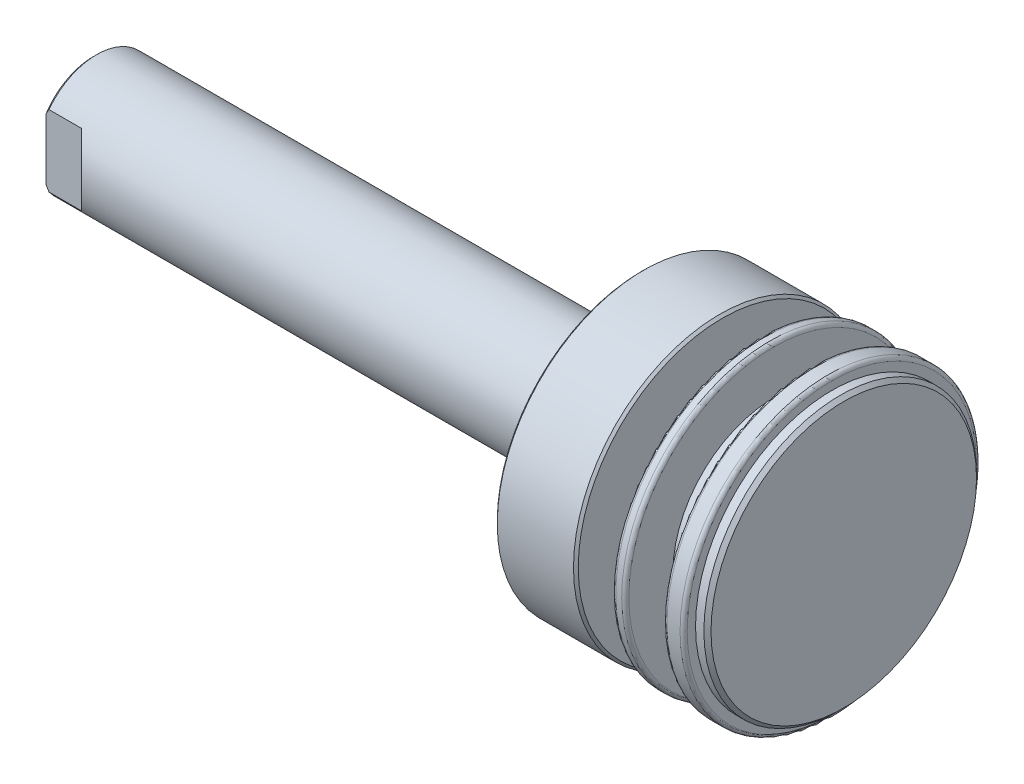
ISO-10303-21;
HEADER;
FILE_DESCRIPTION(('STEP AP214'),'2;1');
FILE_NAME('part.step','',(''),(''),'','','');
FILE_SCHEMA(('AUTOMOTIVE_DESIGN { 1 0 10303 214 1 1 1 1 }'));
ENDSEC;
DATA;
#1=APPLICATION_CONTEXT('core data for automotive mechanical design processes');
#2=APPLICATION_PROTOCOL_DEFINITION('international standard','automotive_design',2000,#1);
#3=PRODUCT_CONTEXT('',#1,'mechanical');
#4=PRODUCT('Part','Part','',(#3));
#5=PRODUCT_RELATED_PRODUCT_CATEGORY('part','',(#4));
#6=PRODUCT_DEFINITION_FORMATION('','',#4);
#7=PRODUCT_DEFINITION_CONTEXT('part definition',#1,'design');
#8=PRODUCT_DEFINITION('design','',#6,#7);
#9=PRODUCT_DEFINITION_SHAPE('','',#8);
#10=(LENGTH_UNIT() NAMED_UNIT(*) SI_UNIT(.MILLI.,.METRE.));
#11=(NAMED_UNIT(*) PLANE_ANGLE_UNIT() SI_UNIT($,.RADIAN.));
#12=(NAMED_UNIT(*) SI_UNIT($,.STERADIAN.) SOLID_ANGLE_UNIT());
#13=UNCERTAINTY_MEASURE_WITH_UNIT(LENGTH_MEASURE(1.E-05),#10,'distance_accuracy_value','');
#14=(GEOMETRIC_REPRESENTATION_CONTEXT(3) GLOBAL_UNCERTAINTY_ASSIGNED_CONTEXT((#13)) GLOBAL_UNIT_ASSIGNED_CONTEXT((#10,
#11,#12)) REPRESENTATION_CONTEXT('',''));
#15=CARTESIAN_POINT('',(0.,0.,0.));
#16=DIRECTION('',(0.,0.,1.));
#17=DIRECTION('',(1.,0.,0.));
#18=AXIS2_PLACEMENT_3D('',#15,#16,#17);
#19=CARTESIAN_POINT('',(57.,11.15,0.));
#20=DIRECTION('',(-1.,0.,0.));
#21=DIRECTION('',(0.,0.,1.));
#22=AXIS2_PLACEMENT_3D('',#19,#20,#21);
#23=PLANE('',#22);
#24=CARTESIAN_POINT('',(57.,0.,0.));
#25=DIRECTION('',(-1.,0.,0.));
#26=DIRECTION('',(0.,0.,1.));
#27=AXIS2_PLACEMENT_3D('',#24,#25,#26);
#28=CIRCLE('',#27,11.15);
#29=CARTESIAN_POINT('',(57.,0.,11.15));
#30=VERTEX_POINT('',#29);
#31=EDGE_CURVE('E356',#30,#30,#28,.T.);
#32=ORIENTED_EDGE('',*,*,#31,.F.);
#33=EDGE_LOOP('',(#32));
#34=FACE_BOUND('',#33,.T.);
#35=ADVANCED_FACE('F17',(#34),#23,.F.);
#36=CARTESIAN_POINT('',(56.7,0.,0.));
#37=DIRECTION('',(-1.,0.,0.));
#38=DIRECTION('',(0.,0.,1.));
#39=AXIS2_PLACEMENT_3D('',#36,#37,#38);
#40=CONICAL_SURFACE('',#39,11.45,0.78539816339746);
#41=CARTESIAN_POINT('',(56.7,0.,0.));
#42=DIRECTION('',(-1.,0.,0.));
#43=DIRECTION('',(0.,0.,1.));
#44=AXIS2_PLACEMENT_3D('',#41,#42,#43);
#45=CIRCLE('',#44,11.45);
#46=CARTESIAN_POINT('',(56.7,0.,11.45));
#47=VERTEX_POINT('',#46);
#48=EDGE_CURVE('E348',#47,#47,#45,.T.);
#49=ORIENTED_EDGE('',*,*,#48,.F.);
#50=EDGE_LOOP('',(#49));
#51=FACE_BOUND('',#50,.T.);
#52=ORIENTED_EDGE('',*,*,#31,.T.);
#53=EDGE_LOOP('',(#52));
#54=FACE_BOUND('',#53,.T.);
#55=ADVANCED_FACE('F395',(#51,#54),#40,.T.);
#56=CARTESIAN_POINT('',(57.,0.,0.));
#57=DIRECTION('',(-1.,0.,0.));
#58=DIRECTION('',(0.,0.,1.));
#59=AXIS2_PLACEMENT_3D('',#56,#57,#58);
#60=CYLINDRICAL_SURFACE('',#59,11.45);
#61=CARTESIAN_POINT('',(56.,0.,0.));
#62=DIRECTION('',(-1.,0.,0.));
#63=DIRECTION('',(0.,0.,1.));
#64=AXIS2_PLACEMENT_3D('',#61,#62,#63);
#65=CIRCLE('',#64,11.45);
#66=CARTESIAN_POINT('',(56.,0.,11.45));
#67=VERTEX_POINT('',#66);
#68=EDGE_CURVE('E355',#67,#67,#65,.F.);
#69=ORIENTED_EDGE('',*,*,#68,.T.);
#70=EDGE_LOOP('',(#69));
#71=FACE_BOUND('',#70,.T.);
#72=ORIENTED_EDGE('',*,*,#48,.T.);
#73=EDGE_LOOP('',(#72));
#74=FACE_BOUND('',#73,.T.);
#75=ADVANCED_FACE('F402',(#71,#74),#60,.T.);
#76=CARTESIAN_POINT('',(56.,12.15,0.));
#77=DIRECTION('',(-1.,0.,0.));
#78=DIRECTION('',(0.,0.,1.));
#79=AXIS2_PLACEMENT_3D('',#76,#77,#78);
#80=PLANE('',#79);
#81=ORIENTED_EDGE('',*,*,#68,.F.);
#82=EDGE_LOOP('',(#81));
#83=FACE_BOUND('',#82,.T.);
#84=CARTESIAN_POINT('',(56.,0.,0.));
#85=DIRECTION('',(-1.,0.,0.));
#86=DIRECTION('',(0.,0.,-1.));
#87=AXIS2_PLACEMENT_3D('',#84,#85,#86);
#88=CIRCLE('',#87,12.15);
#89=CARTESIAN_POINT('',(56.,0.,-12.15));
#90=VERTEX_POINT('',#89);
#91=CARTESIAN_POINT('',(56.,0.,12.15));
#92=VERTEX_POINT('',#91);
#93=EDGE_CURVE('E384',#90,#92,#88,.T.);
#94=ORIENTED_EDGE('',*,*,#93,.F.);
#95=CARTESIAN_POINT('',(56.,0.,0.));
#96=DIRECTION('',(-1.,0.,0.));
#97=DIRECTION('',(0.,0.,1.));
#98=AXIS2_PLACEMENT_3D('',#95,#96,#97);
#99=CIRCLE('',#98,12.15);
#100=EDGE_CURVE('E327',#92,#90,#99,.T.);
#101=ORIENTED_EDGE('',*,*,#100,.F.);
#102=EDGE_LOOP('',(#94,#101));
#103=FACE_BOUND('',#102,.T.);
#104=ADVANCED_FACE('F336',(#83,#103),#80,.F.);
#105=CARTESIAN_POINT('',(55.7,0.,0.));
#106=DIRECTION('',(-1.,0.,0.));
#107=DIRECTION('',(0.,0.,1.));
#108=AXIS2_PLACEMENT_3D('',#105,#106,#107);
#109=TOROIDAL_SURFACE('',#108,12.15,0.299999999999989);
#110=CARTESIAN_POINT('',(55.7,0.,0.));
#111=DIRECTION('',(-1.,0.,0.));
#112=DIRECTION('',(0.,0.,1.));
#113=AXIS2_PLACEMENT_3D('',#110,#111,#112);
#114=CIRCLE('',#113,12.45);
#115=CARTESIAN_POINT('',(55.7,0.,12.45));
#116=VERTEX_POINT('',#115);
#117=EDGE_CURVE('E324',#116,#116,#114,.T.);
#118=ORIENTED_EDGE('',*,*,#117,.F.);
#119=EDGE_LOOP('',(#118));
#120=FACE_BOUND('',#119,.T.);
#121=ORIENTED_EDGE('',*,*,#100,.T.);
#122=ORIENTED_EDGE('',*,*,#93,.T.);
#123=EDGE_LOOP('',(#121,#122));
#124=FACE_BOUND('',#123,.T.);
#125=ADVANCED_FACE('F332',(#120,#124),#109,.T.);
#126=CARTESIAN_POINT('',(57.,0.,0.));
#127=DIRECTION('',(-1.,0.,0.));
#128=DIRECTION('',(0.,0.,1.));
#129=AXIS2_PLACEMENT_3D('',#126,#127,#128);
#130=CYLINDRICAL_SURFACE('',#129,12.45);
#131=CARTESIAN_POINT('',(54.6,0.,0.));
#132=DIRECTION('',(-1.,0.,0.));
#133=DIRECTION('',(0.,0.,1.));
#134=AXIS2_PLACEMENT_3D('',#131,#132,#133);
#135=CIRCLE('',#134,12.45);
#136=CARTESIAN_POINT('',(54.6,0.,12.45));
#137=VERTEX_POINT('',#136);
#138=EDGE_CURVE('E316',#137,#137,#135,.T.);
#139=ORIENTED_EDGE('',*,*,#138,.F.);
#140=EDGE_LOOP('',(#139));
#141=FACE_BOUND('',#140,.T.);
#142=ORIENTED_EDGE('',*,*,#117,.T.);
#143=EDGE_LOOP('',(#142));
#144=FACE_BOUND('',#143,.T.);
#145=ADVANCED_FACE('F301',(#141,#144),#130,.T.);
#146=CARTESIAN_POINT('',(54.6,0.,0.));
#147=DIRECTION('',(-1.,0.,0.));
#148=DIRECTION('',(0.,0.,1.));
#149=AXIS2_PLACEMENT_3D('',#146,#147,#148);
#150=TOROIDAL_SURFACE('',#149,12.15,0.299999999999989);
#151=CARTESIAN_POINT('',(54.3,0.,0.));
#152=DIRECTION('',(1.,0.,0.));
#153=DIRECTION('',(0.,0.,1.));
#154=AXIS2_PLACEMENT_3D('',#151,#152,#153);
#155=CIRCLE('',#154,12.15);
#156=CARTESIAN_POINT('',(54.3,0.,12.15));
#157=VERTEX_POINT('',#156);
#158=CARTESIAN_POINT('',(54.3,0.,-12.15));
#159=VERTEX_POINT('',#158);
#160=EDGE_CURVE('E283',#157,#159,#155,.T.);
#161=ORIENTED_EDGE('',*,*,#160,.T.);
#162=CARTESIAN_POINT('',(54.3,0.,0.));
#163=DIRECTION('',(1.,0.,0.));
#164=DIRECTION('',(0.,0.,-1.));
#165=AXIS2_PLACEMENT_3D('',#162,#163,#164);
#166=CIRCLE('',#165,12.15);
#167=EDGE_CURVE('E312',#159,#157,#166,.T.);
#168=ORIENTED_EDGE('',*,*,#167,.T.);
#169=EDGE_LOOP('',(#161,#168));
#170=FACE_BOUND('',#169,.T.);
#171=ORIENTED_EDGE('',*,*,#138,.T.);
#172=EDGE_LOOP('',(#171));
#173=FACE_BOUND('',#172,.T.);
#174=ADVANCED_FACE('F289',(#170,#173),#150,.T.);
#175=CARTESIAN_POINT('',(54.3,8.45,0.));
#176=DIRECTION('',(1.,0.,0.));
#177=DIRECTION('',(0.,0.,-1.));
#178=AXIS2_PLACEMENT_3D('',#175,#176,#177);
#179=PLANE('',#178);
#180=ORIENTED_EDGE('',*,*,#160,.F.);
#181=ORIENTED_EDGE('',*,*,#167,.F.);
#182=EDGE_LOOP('',(#180,#181));
#183=FACE_BOUND('',#182,.T.);
#184=CARTESIAN_POINT('',(54.3,0.,0.));
#185=DIRECTION('',(-1.,0.,0.));
#186=DIRECTION('',(0.,0.,1.));
#187=AXIS2_PLACEMENT_3D('',#184,#185,#186);
#188=CIRCLE('',#187,8.45);
#189=CARTESIAN_POINT('',(54.3,0.,8.45));
#190=VERTEX_POINT('',#189);
#191=EDGE_CURVE('E379',#190,#190,#188,.T.);
#192=ORIENTED_EDGE('',*,*,#191,.F.);
#193=EDGE_LOOP('',(#192));
#194=FACE_BOUND('',#193,.T.);
#195=ADVANCED_FACE('F300',(#183,#194),#179,.F.);
#196=CARTESIAN_POINT('',(57.,0.,0.));
#197=DIRECTION('',(-1.,0.,0.));
#198=DIRECTION('',(0.,0.,1.));
#199=AXIS2_PLACEMENT_3D('',#196,#197,#198);
#200=CYLINDRICAL_SURFACE('',#199,8.45);
#201=CARTESIAN_POINT('',(51.1,0.,0.));
#202=DIRECTION('',(-1.,0.,0.));
#203=DIRECTION('',(0.,0.,1.));
#204=AXIS2_PLACEMENT_3D('',#201,#202,#203);
#205=CIRCLE('',#204,8.45);
#206=CARTESIAN_POINT('',(51.1,0.,8.45));
#207=VERTEX_POINT('',#206);
#208=EDGE_CURVE('E375',#207,#207,#205,.F.);
#209=ORIENTED_EDGE('',*,*,#208,.T.);
#210=EDGE_LOOP('',(#209));
#211=FACE_BOUND('',#210,.T.);
#212=ORIENTED_EDGE('',*,*,#191,.T.);
#213=EDGE_LOOP('',(#212));
#214=FACE_BOUND('',#213,.T.);
#215=ADVANCED_FACE('F530',(#211,#214),#200,.T.);
#216=CARTESIAN_POINT('',(51.1,12.15,0.));
#217=DIRECTION('',(-1.,0.,0.));
#218=DIRECTION('',(0.,0.,1.));
#219=AXIS2_PLACEMENT_3D('',#216,#217,#218);
#220=PLANE('',#219);
#221=ORIENTED_EDGE('',*,*,#208,.F.);
#222=EDGE_LOOP('',(#221));
#223=FACE_BOUND('',#222,.T.);
#224=CARTESIAN_POINT('',(51.1,0.,0.));
#225=DIRECTION('',(-1.,0.,0.));
#226=DIRECTION('',(0.,0.,-1.));
#227=AXIS2_PLACEMENT_3D('',#224,#225,#226);
#228=CIRCLE('',#227,12.15);
#229=CARTESIAN_POINT('',(51.1,0.,-12.15));
#230=VERTEX_POINT('',#229);
#231=CARTESIAN_POINT('',(51.1,0.,12.15));
#232=VERTEX_POINT('',#231);
#233=EDGE_CURVE('E378',#230,#232,#228,.T.);
#234=ORIENTED_EDGE('',*,*,#233,.F.);
#235=CARTESIAN_POINT('',(51.1,0.,0.));
#236=DIRECTION('',(-1.,0.,0.));
#237=DIRECTION('',(0.,0.,1.));
#238=AXIS2_PLACEMENT_3D('',#235,#236,#237);
#239=CIRCLE('',#238,12.15);
#240=EDGE_CURVE('E239',#232,#230,#239,.T.);
#241=ORIENTED_EDGE('',*,*,#240,.F.);
#242=EDGE_LOOP('',(#234,#241));
#243=FACE_BOUND('',#242,.T.);
#244=ADVANCED_FACE('F255',(#223,#243),#220,.F.);
#245=CARTESIAN_POINT('',(50.8,0.,0.));
#246=DIRECTION('',(-1.,0.,0.));
#247=DIRECTION('',(0.,0.,1.));
#248=AXIS2_PLACEMENT_3D('',#245,#246,#247);
#249=TOROIDAL_SURFACE('',#248,12.15,0.299999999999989);
#250=CARTESIAN_POINT('',(50.8,0.,0.));
#251=DIRECTION('',(-1.,0.,0.));
#252=DIRECTION('',(0.,0.,1.));
#253=AXIS2_PLACEMENT_3D('',#250,#251,#252);
#254=CIRCLE('',#253,12.45);
#255=CARTESIAN_POINT('',(50.8,0.,12.45));
#256=VERTEX_POINT('',#255);
#257=EDGE_CURVE('E234',#256,#256,#254,.T.);
#258=ORIENTED_EDGE('',*,*,#257,.F.);
#259=EDGE_LOOP('',(#258));
#260=FACE_BOUND('',#259,.T.);
#261=ORIENTED_EDGE('',*,*,#240,.T.);
#262=ORIENTED_EDGE('',*,*,#233,.T.);
#263=EDGE_LOOP('',(#261,#262));
#264=FACE_BOUND('',#263,.T.);
#265=ADVANCED_FACE('F250',(#260,#264),#249,.T.);
#266=CARTESIAN_POINT('',(57.,0.,0.));
#267=DIRECTION('',(-1.,0.,0.));
#268=DIRECTION('',(0.,0.,1.));
#269=AXIS2_PLACEMENT_3D('',#266,#267,#268);
#270=CYLINDRICAL_SURFACE('',#269,12.45);
#271=CARTESIAN_POINT('',(50.3,0.,0.));
#272=DIRECTION('',(-1.,0.,0.));
#273=DIRECTION('',(0.,0.,1.));
#274=AXIS2_PLACEMENT_3D('',#271,#272,#273);
#275=CIRCLE('',#274,12.45);
#276=CARTESIAN_POINT('',(50.3,0.,12.45));
#277=VERTEX_POINT('',#276);
#278=EDGE_CURVE('E231',#277,#277,#275,.T.);
#279=ORIENTED_EDGE('',*,*,#278,.F.);
#280=EDGE_LOOP('',(#279));
#281=FACE_BOUND('',#280,.T.);
#282=ORIENTED_EDGE('',*,*,#257,.T.);
#283=EDGE_LOOP('',(#282));
#284=FACE_BOUND('',#283,.T.);
#285=ADVANCED_FACE('F254',(#281,#284),#270,.T.);
#286=CARTESIAN_POINT('',(50.3,0.,0.));
#287=DIRECTION('',(-1.,0.,0.));
#288=DIRECTION('',(0.,0.,1.));
#289=AXIS2_PLACEMENT_3D('',#286,#287,#288);
#290=TOROIDAL_SURFACE('',#289,12.15,0.299999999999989);
#291=CARTESIAN_POINT('',(50.,0.,0.));
#292=DIRECTION('',(1.,0.,0.));
#293=DIRECTION('',(0.,0.,1.));
#294=AXIS2_PLACEMENT_3D('',#291,#292,#293);
#295=CIRCLE('',#294,12.15);
#296=CARTESIAN_POINT('',(50.,0.,12.15));
#297=VERTEX_POINT('',#296);
#298=CARTESIAN_POINT('',(50.,0.,-12.15));
#299=VERTEX_POINT('',#298);
#300=EDGE_CURVE('E222',#297,#299,#295,.T.);
#301=ORIENTED_EDGE('',*,*,#300,.T.);
#302=CARTESIAN_POINT('',(50.,0.,0.));
#303=DIRECTION('',(1.,0.,0.));
#304=DIRECTION('',(0.,0.,-1.));
#305=AXIS2_PLACEMENT_3D('',#302,#303,#304);
#306=CIRCLE('',#305,12.15);
#307=EDGE_CURVE('E218',#299,#297,#306,.T.);
#308=ORIENTED_EDGE('',*,*,#307,.T.);
#309=EDGE_LOOP('',(#301,#308));
#310=FACE_BOUND('',#309,.T.);
#311=ORIENTED_EDGE('',*,*,#278,.T.);
#312=EDGE_LOOP('',(#311));
#313=FACE_BOUND('',#312,.T.);
#314=ADVANCED_FACE('F194',(#310,#313),#290,.T.);
#315=CARTESIAN_POINT('',(50.,6.5,0.));
#316=DIRECTION('',(1.,0.,0.));
#317=DIRECTION('',(0.,0.,-1.));
#318=AXIS2_PLACEMENT_3D('',#315,#316,#317);
#319=PLANE('',#318);
#320=ORIENTED_EDGE('',*,*,#300,.F.);
#321=ORIENTED_EDGE('',*,*,#307,.F.);
#322=EDGE_LOOP('',(#320,#321));
#323=FACE_BOUND('',#322,.T.);
#324=CARTESIAN_POINT('',(50.,0.,0.));
#325=DIRECTION('',(-1.,0.,0.));
#326=DIRECTION('',(0.,0.,1.));
#327=AXIS2_PLACEMENT_3D('',#324,#325,#326);
#328=CIRCLE('',#327,6.5);
#329=CARTESIAN_POINT('',(50.,0.,6.5));
#330=VERTEX_POINT('',#329);
#331=EDGE_CURVE('E227',#330,#330,#328,.T.);
#332=ORIENTED_EDGE('',*,*,#331,.F.);
#333=EDGE_LOOP('',(#332));
#334=FACE_BOUND('',#333,.T.);
#335=ADVANCED_FACE('F189',(#323,#334),#319,.F.);
#336=CARTESIAN_POINT('',(57.,0.,0.));
#337=DIRECTION('',(-1.,0.,0.));
#338=DIRECTION('',(0.,0.,1.));
#339=AXIS2_PLACEMENT_3D('',#336,#337,#338);
#340=CYLINDRICAL_SURFACE('',#339,6.5);
#341=CARTESIAN_POINT('',(46.8,0.,0.));
#342=DIRECTION('',(-1.,0.,0.));
#343=DIRECTION('',(0.,0.,1.));
#344=AXIS2_PLACEMENT_3D('',#341,#342,#343);
#345=CIRCLE('',#344,6.5);
#346=CARTESIAN_POINT('',(46.8,0.,6.5));
#347=VERTEX_POINT('',#346);
#348=EDGE_CURVE('E229',#347,#347,#345,.F.);
#349=ORIENTED_EDGE('',*,*,#348,.T.);
#350=EDGE_LOOP('',(#349));
#351=FACE_BOUND('',#350,.T.);
#352=ORIENTED_EDGE('',*,*,#331,.T.);
#353=EDGE_LOOP('',(#352));
#354=FACE_BOUND('',#353,.T.);
#355=ADVANCED_FACE('F185',(#351,#354),#340,.T.);
#356=CARTESIAN_POINT('',(46.8,12.1,0.));
#357=DIRECTION('',(-1.,0.,0.));
#358=DIRECTION('',(0.,0.,1.));
#359=AXIS2_PLACEMENT_3D('',#356,#357,#358);
#360=PLANE('',#359);
#361=ORIENTED_EDGE('',*,*,#348,.F.);
#362=EDGE_LOOP('',(#361));
#363=FACE_BOUND('',#362,.T.);
#364=CARTESIAN_POINT('',(46.8,0.,0.));
#365=DIRECTION('',(-1.,0.,0.));
#366=DIRECTION('',(0.,0.,1.));
#367=AXIS2_PLACEMENT_3D('',#364,#365,#366);
#368=CIRCLE('',#367,12.1);
#369=CARTESIAN_POINT('',(46.8,0.,12.1));
#370=VERTEX_POINT('',#369);
#371=EDGE_CURVE('E369',#370,#370,#368,.T.);
#372=ORIENTED_EDGE('',*,*,#371,.F.);
#373=EDGE_LOOP('',(#372));
#374=FACE_BOUND('',#373,.T.);
#375=ADVANCED_FACE('F181',(#363,#374),#360,.F.);
#376=CARTESIAN_POINT('',(6.00000000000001,0.,0.));
#377=DIRECTION('',(-1.,0.,0.));
#378=DIRECTION('',(0.,0.,1.));
#379=AXIS2_PLACEMENT_3D('',#376,#377,#378);
#380=CONICAL_SURFACE('',#379,2.06700000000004,1.04719755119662);
#381=CARTESIAN_POINT('',(7.19338300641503,0.,-1.11022302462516E-13));
#382=VERTEX_POINT('',#381);
#383=VERTEX_LOOP('',#382);
#384=FACE_BOUND('',#383,.T.);
#385=CARTESIAN_POINT('',(6.,0.,0.));
#386=DIRECTION('',(-1.,0.,0.));
#387=DIRECTION('',(0.,0.,1.));
#388=AXIS2_PLACEMENT_3D('',#385,#386,#387);
#389=CIRCLE('',#388,2.067);
#390=CARTESIAN_POINT('',(6.,0.,2.067));
#391=VERTEX_POINT('',#390);
#392=EDGE_CURVE('E372',#391,#391,#389,.T.);
#393=ORIENTED_EDGE('',*,*,#392,.T.);
#394=EDGE_LOOP('',(#393));
#395=FACE_BOUND('',#394,.T.);
#396=ADVANCED_FACE('F177',(#384,#395),#380,.F.);
#397=CARTESIAN_POINT('',(46.6,0.,0.));
#398=DIRECTION('',(-1.,0.,0.));
#399=DIRECTION('',(0.,0.,1.));
#400=AXIS2_PLACEMENT_3D('',#397,#398,#399);
#401=CONICAL_SURFACE('',#400,12.3,0.785398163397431);
#402=ORIENTED_EDGE('',*,*,#371,.T.);
#403=EDGE_LOOP('',(#402));
#404=FACE_BOUND('',#403,.T.);
#405=CARTESIAN_POINT('',(46.6,0.,0.));
#406=DIRECTION('',(-1.,0.,0.));
#407=DIRECTION('',(0.,0.,1.));
#408=AXIS2_PLACEMENT_3D('',#405,#406,#407);
#409=CIRCLE('',#408,12.3);
#410=CARTESIAN_POINT('',(46.6,0.,12.3));
#411=VERTEX_POINT('',#410);
#412=EDGE_CURVE('E432',#411,#411,#409,.T.);
#413=ORIENTED_EDGE('',*,*,#412,.F.);
#414=EDGE_LOOP('',(#413));
#415=FACE_BOUND('',#414,.T.);
#416=ADVANCED_FACE('F173',(#404,#415),#401,.T.);
#417=CARTESIAN_POINT('',(7.19338300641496,0.,0.));
#418=DIRECTION('',(-1.,0.,0.));
#419=DIRECTION('',(0.,0.,1.));
#420=AXIS2_PLACEMENT_3D('',#417,#418,#419);
#421=CYLINDRICAL_SURFACE('',#420,2.067);
#422=ORIENTED_EDGE('',*,*,#392,.F.);
#423=EDGE_LOOP('',(#422));
#424=FACE_BOUND('',#423,.T.);
#425=CARTESIAN_POINT('',(-5.566999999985,0.,0.));
#426=DIRECTION('',(-1.,0.,0.));
#427=DIRECTION('',(0.,0.,1.));
#428=AXIS2_PLACEMENT_3D('',#425,#426,#427);
#429=CIRCLE('',#428,2.06700000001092);
#430=CARTESIAN_POINT('',(-5.566999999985,0.,2.06700000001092));
#431=VERTEX_POINT('',#430);
#432=EDGE_CURVE('E430',#431,#431,#429,.T.);
#433=ORIENTED_EDGE('',*,*,#432,.T.);
#434=EDGE_LOOP('',(#433));
#435=FACE_BOUND('',#434,.T.);
#436=ADVANCED_FACE('F169',(#424,#435),#421,.F.);
#437=CARTESIAN_POINT('',(57.,0.,0.));
#438=DIRECTION('',(-1.,0.,0.));
#439=DIRECTION('',(0.,0.,1.));
#440=AXIS2_PLACEMENT_3D('',#437,#438,#439);
#441=CYLINDRICAL_SURFACE('',#440,12.3);
#442=ORIENTED_EDGE('',*,*,#412,.T.);
#443=EDGE_LOOP('',(#442));
#444=FACE_BOUND('',#443,.T.);
#445=CARTESIAN_POINT('',(40.2,0.,0.));
#446=DIRECTION('',(1.,0.,0.));
#447=DIRECTION('',(0.,0.,-1.));
#448=AXIS2_PLACEMENT_3D('',#445,#446,#447);
#449=CIRCLE('',#448,12.3);
#450=CARTESIAN_POINT('',(40.2,0.,-12.3));
#451=VERTEX_POINT('',#450);
#452=EDGE_CURVE('E142',#451,#451,#449,.F.);
#453=ORIENTED_EDGE('',*,*,#452,.F.);
#454=EDGE_LOOP('',(#453));
#455=FACE_BOUND('',#454,.T.);
#456=ADVANCED_FACE('F165',(#444,#455),#441,.T.);
#457=CARTESIAN_POINT('',(-6.00000000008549,0.,0.));
#458=DIRECTION('',(-1.,0.,0.));
#459=DIRECTION('',(0.,-1.,0.));
#460=AXIS2_PLACEMENT_3D('',#457,#458,#459);
#461=CONICAL_SURFACE('',#460,2.50000000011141,0.785398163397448);
#462=ORIENTED_EDGE('',*,*,#432,.F.);
#463=EDGE_LOOP('',(#462));
#464=FACE_BOUND('',#463,.T.);
#465=CARTESIAN_POINT('',(-6.00000000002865,0.,0.));
#466=DIRECTION('',(-1.,0.,0.));
#467=DIRECTION('',(0.,-1.,0.));
#468=AXIS2_PLACEMENT_3D('',#465,#466,#467);
#469=CIRCLE('',#468,2.50000000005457);
#470=CARTESIAN_POINT('',(-6.00000000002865,-2.50000000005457,0.));
#471=VERTEX_POINT('',#470);
#472=EDGE_CURVE('E83',#471,#471,#469,.T.);
#473=ORIENTED_EDGE('',*,*,#472,.T.);
#474=EDGE_LOOP('',(#473));
#475=FACE_BOUND('',#474,.T.);
#476=ADVANCED_FACE('F161',(#464,#475),#461,.F.);
#477=CARTESIAN_POINT('',(40.2,0.,0.));
#478=DIRECTION('',(1.,0.,0.));
#479=DIRECTION('',(0.,0.,-1.));
#480=AXIS2_PLACEMENT_3D('',#477,#478,#479);
#481=CONICAL_SURFACE('',#480,12.3,0.785398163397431);
#482=CARTESIAN_POINT('',(40.,0.,0.));
#483=DIRECTION('',(1.,0.,0.));
#484=DIRECTION('',(0.,0.,-1.));
#485=AXIS2_PLACEMENT_3D('',#482,#483,#484);
#486=CIRCLE('',#485,12.1);
#487=CARTESIAN_POINT('',(40.,0.,-12.1));
#488=VERTEX_POINT('',#487);
#489=EDGE_CURVE('E82',#488,#488,#486,.T.);
#490=ORIENTED_EDGE('',*,*,#489,.T.);
#491=EDGE_LOOP('',(#490));
#492=FACE_BOUND('',#491,.T.);
#493=ORIENTED_EDGE('',*,*,#452,.T.);
#494=EDGE_LOOP('',(#493));
#495=FACE_BOUND('',#494,.T.);
#496=ADVANCED_FACE('F157',(#492,#495),#481,.T.);
#497=CARTESIAN_POINT('',(-6.,0.,0.));
#498=DIRECTION('',(1.,0.,0.));
#499=DIRECTION('',(0.,0.,-1.));
#500=AXIS2_PLACEMENT_3D('',#497,#498,#499);
#501=PLANE('',#500);
#502=ORIENTED_EDGE('',*,*,#472,.F.);
#503=EDGE_LOOP('',(#502));
#504=FACE_BOUND('',#503,.T.);
#505=DIRECTION('',(0.,1.,0.));
#506=VECTOR('',#505,1.);
#507=CARTESIAN_POINT('',(-6.,-8.,-4.));
#508=LINE('',#507,#506);
#509=CARTESIAN_POINT('',(-5.9999999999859,2.56173769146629,-4.));
#510=VERTEX_POINT('',#509);
#511=CARTESIAN_POINT('',(-5.9999999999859,-2.56173769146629,-4.));
#512=VERTEX_POINT('',#511);
#513=EDGE_CURVE('E79',#510,#512,#508,.F.);
#514=ORIENTED_EDGE('',*,*,#513,.T.);
#515=CARTESIAN_POINT('',(-5.99999999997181,0.,0.));
#516=DIRECTION('',(1.,0.,0.));
#517=DIRECTION('',(0.,0.,-1.));
#518=AXIS2_PLACEMENT_3D('',#515,#516,#517);
#519=CIRCLE('',#518,4.75000000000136);
#520=CARTESIAN_POINT('',(-5.9999999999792,-2.56173769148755,3.99999999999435));
#521=VERTEX_POINT('',#520);
#522=EDGE_CURVE('E72',#521,#512,#519,.T.);
#523=ORIENTED_EDGE('',*,*,#522,.F.);
#524=DIRECTION('',(0.,1.,0.));
#525=VECTOR('',#524,1.);
#526=CARTESIAN_POINT('',(-6.,-8.,4.));
#527=LINE('',#526,#525);
#528=CARTESIAN_POINT('',(-5.9999999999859,2.56173769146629,4.));
#529=VERTEX_POINT('',#528);
#530=EDGE_CURVE('E77',#521,#529,#527,.T.);
#531=ORIENTED_EDGE('',*,*,#530,.T.);
#532=CARTESIAN_POINT('',(-5.99999999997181,0.,0.));
#533=DIRECTION('',(1.,0.,0.));
#534=DIRECTION('',(0.,0.,-1.));
#535=AXIS2_PLACEMENT_3D('',#532,#533,#534);
#536=CIRCLE('',#535,4.75000000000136);
#537=EDGE_CURVE('E91',#510,#529,#536,.T.);
#538=ORIENTED_EDGE('',*,*,#537,.F.);
#539=EDGE_LOOP('',(#514,#523,#531,#538));
#540=FACE_BOUND('',#539,.T.);
#541=ADVANCED_FACE('F74',(#504,#540),#501,.F.);
#542=CARTESIAN_POINT('',(-5.74999999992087,0.,0.));
#543=DIRECTION('',(1.,0.,0.));
#544=DIRECTION('',(0.,0.,-1.));
#545=AXIS2_PLACEMENT_3D('',#542,#543,#544);
#546=CONICAL_SURFACE('',#545,4.99999999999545,0.785398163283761);
#547=CARTESIAN_POINT('',(-5.75,0.,0.));
#548=DIRECTION('',(-1.,0.,0.));
#549=DIRECTION('',(0.,0.,1.));
#550=AXIS2_PLACEMENT_3D('',#547,#548,#549);
#551=CIRCLE('',#550,5.);
#552=CARTESIAN_POINT('',(-5.74999999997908,-2.99999999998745,3.99999999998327));
#553=VERTEX_POINT('',#552);
#554=CARTESIAN_POINT('',(-5.74999999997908,-2.99999999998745,-3.99999999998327));
#555=VERTEX_POINT('',#554);
#556=EDGE_CURVE('E89',#553,#555,#551,.F.);
#557=ORIENTED_EDGE('',*,*,#556,.F.);
#558=CARTESIAN_POINT('',(-5.74999999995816,-2.9999999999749,3.99999999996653));
#559=CARTESIAN_POINT('',(-5.7611048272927,-2.98149191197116,4.00000000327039));
#560=CARTESIAN_POINT('',(-5.7721613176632,-2.96295479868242,4.00000004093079));
#561=CARTESIAN_POINT('',(-5.79409088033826,-2.92596211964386,4.00000014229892));
#562=CARTESIAN_POINT('',(-5.80496470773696,-2.90750700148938,4.00000020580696));
#563=CARTESIAN_POINT('',(-5.82652896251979,-2.87067686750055,4.00000031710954));
#564=CARTESIAN_POINT('',(-5.83722015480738,-2.85230229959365,4.00000036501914));
#565=CARTESIAN_POINT('',(-5.85841912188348,-2.81563176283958,4.00000042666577));
#566=CARTESIAN_POINT('',(-5.86892767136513,-2.79733624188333,4.00000044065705));
#567=CARTESIAN_POINT('',(-5.8897613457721,-2.76082224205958,4.00000043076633));
#568=CARTESIAN_POINT('',(-5.90008725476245,-2.74260421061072,4.00000040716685));
#569=CARTESIAN_POINT('',(-5.92055563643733,-2.70624357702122,4.0000003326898));
#570=CARTESIAN_POINT('',(-5.93069890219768,-2.68810142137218,4.00000028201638));
#571=CARTESIAN_POINT('',(-5.95080199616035,-2.65189086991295,4.00000017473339));
#572=CARTESIAN_POINT('',(-5.96076262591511,-2.6338229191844,4.00000011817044));
#573=CARTESIAN_POINT('',(-5.98050041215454,-2.59775905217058,4.00000003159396));
#574=CARTESIAN_POINT('',(-5.99027837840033,-2.57976357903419,4.00000000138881));
#575=CARTESIAN_POINT('',(-5.99999999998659,-2.56173769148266,3.9999999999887));
#576=B_SPLINE_CURVE_WITH_KNOTS('',3,(#558,#559,#560,#561,#562,#563,#564,#565,#566,#567,#568,
#569,#570,#571,#572,#573,#574,#575),.UNSPECIFIED.,.F.,.F.,(4,2,2,2,2,2,2,2,4),(0.,
0.0647517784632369,0.129012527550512,0.192787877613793,0.256083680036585,0.318906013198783,
0.381261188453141,0.443155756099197,0.504596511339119),.UNSPECIFIED.);
#577=EDGE_CURVE('E86',#553,#521,#576,.T.);
#578=ORIENTED_EDGE('',*,*,#577,.T.);
#579=ORIENTED_EDGE('',*,*,#522,.T.);
#580=CARTESIAN_POINT('',(-5.99999999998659,-2.56173769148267,-3.9999999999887));
#581=CARTESIAN_POINT('',(-5.99027837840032,-2.57976357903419,-4.00000000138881));
#582=CARTESIAN_POINT('',(-5.98050041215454,-2.59775905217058,-4.00000003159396));
#583=CARTESIAN_POINT('',(-5.96076262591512,-2.6338229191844,-4.00000011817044));
#584=CARTESIAN_POINT('',(-5.95080199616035,-2.65189086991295,-4.00000017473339));
#585=CARTESIAN_POINT('',(-5.93069890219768,-2.68810142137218,-4.00000028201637));
#586=CARTESIAN_POINT('',(-5.92055563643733,-2.70624357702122,-4.0000003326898));
#587=CARTESIAN_POINT('',(-5.90008725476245,-2.74260421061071,-4.00000040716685));
#588=CARTESIAN_POINT('',(-5.8897613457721,-2.76082224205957,-4.00000043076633));
#589=CARTESIAN_POINT('',(-5.86892767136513,-2.79733624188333,-4.00000044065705));
#590=CARTESIAN_POINT('',(-5.85841912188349,-2.81563176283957,-4.00000042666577));
#591=CARTESIAN_POINT('',(-5.83722015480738,-2.85230229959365,-4.00000036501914));
#592=CARTESIAN_POINT('',(-5.82652896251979,-2.87067686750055,-4.00000031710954));
#593=CARTESIAN_POINT('',(-5.80496470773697,-2.90750700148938,-4.00000020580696));
#594=CARTESIAN_POINT('',(-5.79409088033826,-2.92596211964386,-4.00000014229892));
#595=CARTESIAN_POINT('',(-5.7721613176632,-2.96295479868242,-4.00000004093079));
#596=CARTESIAN_POINT('',(-5.7611048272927,-2.98149191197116,-4.00000000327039));
#597=CARTESIAN_POINT('',(-5.74999999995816,-2.9999999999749,-3.99999999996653));
#598=B_SPLINE_CURVE_WITH_KNOTS('',3,(#580,#581,#582,#583,#584,#585,#586,#587,#588,#589,#590,
#591,#592,#593,#594,#595,#596,#597),.UNSPECIFIED.,.F.,.F.,(4,2,2,2,2,2,2,2,4),(0.,
0.0614407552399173,0.123335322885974,0.185690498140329,0.248512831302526,0.311808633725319,
0.3755839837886,0.439844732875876,0.504596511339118),.UNSPECIFIED.);
#599=EDGE_CURVE('E106',#512,#555,#598,.T.);
#600=ORIENTED_EDGE('',*,*,#599,.T.);
#601=EDGE_LOOP('',(#557,#578,#579,#600));
#602=FACE_BOUND('',#601,.T.);
#603=ADVANCED_FACE('F87',(#602),#546,.T.);
#604=CARTESIAN_POINT('',(40.,5.,0.));
#605=DIRECTION('',(1.,0.,0.));
#606=DIRECTION('',(0.,0.,-1.));
#607=AXIS2_PLACEMENT_3D('',#604,#605,#606);
#608=PLANE('',#607);
#609=ORIENTED_EDGE('',*,*,#489,.F.);
#610=EDGE_LOOP('',(#609));
#611=FACE_BOUND('',#610,.T.);
#612=CARTESIAN_POINT('',(40.,0.,0.));
#613=DIRECTION('',(-1.,0.,0.));
#614=DIRECTION('',(0.,0.,1.));
#615=AXIS2_PLACEMENT_3D('',#612,#613,#614);
#616=CIRCLE('',#615,5.);
#617=CARTESIAN_POINT('',(40.,0.,5.));
#618=VERTEX_POINT('',#617);
#619=EDGE_CURVE('E361',#618,#618,#616,.T.);
#620=ORIENTED_EDGE('',*,*,#619,.F.);
#621=EDGE_LOOP('',(#620));
#622=FACE_BOUND('',#621,.T.);
#623=ADVANCED_FACE('F153',(#611,#622),#608,.F.);
#624=CARTESIAN_POINT('',(-3.,-8.,-4.));
#625=DIRECTION('',(0.707106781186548,0.,0.707106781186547));
#626=DIRECTION('',(0.707106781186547,0.,-0.707106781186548));
#627=AXIS2_PLACEMENT_3D('',#624,#625,#626);
#628=PLANE('',#627);
#629=CARTESIAN_POINT('',(-7.,0.,0.));
#630=DIRECTION('',(0.707106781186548,0.,0.707106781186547));
#631=DIRECTION('',(-0.707106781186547,0.,0.707106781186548));
#632=AXIS2_PLACEMENT_3D('',#629,#630,#631);
#633=ELLIPSE('',#632,7.07106781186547,5.);
#634=CARTESIAN_POINT('',(-3.,-3.,-4.));
#635=VERTEX_POINT('',#634);
#636=CARTESIAN_POINT('',(-3.,3.,-4.));
#637=VERTEX_POINT('',#636);
#638=EDGE_CURVE('E358',#635,#637,#633,.T.);
#639=ORIENTED_EDGE('',*,*,#638,.F.);
#640=DIRECTION('',(0.,1.,0.));
#641=VECTOR('',#640,1.);
#642=CARTESIAN_POINT('',(-3.,-8.,-4.));
#643=LINE('',#642,#641);
#644=EDGE_CURVE('E107',#635,#637,#643,.T.);
#645=ORIENTED_EDGE('',*,*,#644,.T.);
#646=EDGE_LOOP('',(#639,#645));
#647=FACE_BOUND('',#646,.T.);
#648=ADVANCED_FACE('F419',(#647),#628,.F.);
#649=CARTESIAN_POINT('',(-6.,-8.,-4.));
#650=DIRECTION('',(0.,0.,1.));
#651=DIRECTION('',(1.,0.,0.));
#652=AXIS2_PLACEMENT_3D('',#649,#650,#651);
#653=PLANE('',#652);
#654=ORIENTED_EDGE('',*,*,#644,.F.);
#655=DIRECTION('',(-1.,0.,0.));
#656=VECTOR('',#655,1.);
#657=CARTESIAN_POINT('',(0.,-3.,-4.));
#658=LINE('',#657,#656);
#659=EDGE_CURVE('E110',#555,#635,#658,.F.);
#660=ORIENTED_EDGE('',*,*,#659,.F.);
#661=ORIENTED_EDGE('',*,*,#599,.F.);
#662=ORIENTED_EDGE('',*,*,#513,.F.);
#663=CARTESIAN_POINT('',(-5.74999999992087,2.99999999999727,-3.99999999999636));
#664=CARTESIAN_POINT('',(-5.76110482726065,2.98149191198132,-4.00000000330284));
#665=CARTESIAN_POINT('',(-5.77216131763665,2.96295479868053,-4.00000004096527));
#666=CARTESIAN_POINT('',(-5.79409088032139,2.92596211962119,-4.00000014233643));
#667=CARTESIAN_POINT('',(-5.8049647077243,2.90750700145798,-4.00000020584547));
#668=CARTESIAN_POINT('',(-5.8265289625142,2.870676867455,-4.00000031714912));
#669=CARTESIAN_POINT('',(-5.83722015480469,2.85230229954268,-4.0000003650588));
#670=CARTESIAN_POINT('',(-5.85841912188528,2.81563176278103,-4.00000042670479));
#671=CARTESIAN_POINT('',(-5.86892767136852,2.79733624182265,-4.00000044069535));
#672=CARTESIAN_POINT('',(-5.88976134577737,2.76082224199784,-4.00000043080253));
#673=CARTESIAN_POINT('',(-5.90008725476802,2.74260421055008,-4.00000040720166));
#674=CARTESIAN_POINT('',(-5.92055563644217,2.706243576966,-4.00000033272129));
#675=CARTESIAN_POINT('',(-5.93069890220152,2.68810142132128,-4.00000028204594));
#676=CARTESIAN_POINT('',(-5.95080199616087,2.65189086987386,-4.00000017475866));
#677=CARTESIAN_POINT('',(-5.96076262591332,2.63382291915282,-4.00000011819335));
#678=CARTESIAN_POINT('',(-5.98050041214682,2.59775905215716,-4.00000003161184));
#679=CARTESIAN_POINT('',(-5.990278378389,2.57976357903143,-4.00000000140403));
#680=CARTESIAN_POINT('',(-5.99999999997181,2.56173769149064,-4.00000000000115));
#681=B_SPLINE_CURVE_WITH_KNOTS('',3,(#663,#664,#665,#666,#667,#668,#669,#670,#671,#672,#673,
#674,#675,#676,#677,#678,#679,#680),.UNSPECIFIED.,.F.,.F.,(4,2,2,2,2,2,2,2,4),(0.,
0.0647517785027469,0.129012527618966,0.192787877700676,0.256083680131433,0.318906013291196,
0.381261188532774,0.443155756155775,0.504596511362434),.UNSPECIFIED.);
#682=CARTESIAN_POINT('',(-5.74999999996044,2.99999999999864,-3.99999999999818));
#683=VERTEX_POINT('',#682);
#684=EDGE_CURVE('E109',#683,#510,#681,.T.);
#685=ORIENTED_EDGE('',*,*,#684,.F.);
#686=DIRECTION('',(-1.,0.,0.));
#687=VECTOR('',#686,1.);
#688=CARTESIAN_POINT('',(0.,3.,-4.));
#689=LINE('',#688,#687);
#690=EDGE_CURVE('E104',#637,#683,#689,.T.);
#691=ORIENTED_EDGE('',*,*,#690,.F.);
#692=EDGE_LOOP('',(#654,#660,#661,#662,#685,#691));
#693=FACE_BOUND('',#692,.T.);
#694=ADVANCED_FACE('F127',(#693),#653,.F.);
#695=CARTESIAN_POINT('',(-5.74999999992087,0.,0.));
#696=DIRECTION('',(1.,0.,0.));
#697=DIRECTION('',(0.,0.,-1.));
#698=AXIS2_PLACEMENT_3D('',#695,#696,#697);
#699=CONICAL_SURFACE('',#698,4.99999999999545,0.785398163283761);
#700=ORIENTED_EDGE('',*,*,#537,.T.);
#701=CARTESIAN_POINT('',(-5.99999999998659,2.56173769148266,3.9999999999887));
#702=CARTESIAN_POINT('',(-5.99027837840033,2.57976357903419,4.00000000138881));
#703=CARTESIAN_POINT('',(-5.98050041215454,2.59775905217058,4.00000003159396));
#704=CARTESIAN_POINT('',(-5.96076262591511,2.6338229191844,4.00000011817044));
#705=CARTESIAN_POINT('',(-5.95080199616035,2.65189086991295,4.00000017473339));
#706=CARTESIAN_POINT('',(-5.93069890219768,2.68810142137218,4.00000028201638));
#707=CARTESIAN_POINT('',(-5.92055563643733,2.70624357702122,4.0000003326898));
#708=CARTESIAN_POINT('',(-5.90008725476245,2.74260421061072,4.00000040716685));
#709=CARTESIAN_POINT('',(-5.8897613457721,2.76082224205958,4.00000043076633));
#710=CARTESIAN_POINT('',(-5.86892767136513,2.79733624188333,4.00000044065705));
#711=CARTESIAN_POINT('',(-5.85841912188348,2.81563176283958,4.00000042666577));
#712=CARTESIAN_POINT('',(-5.83722015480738,2.85230229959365,4.00000036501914));
#713=CARTESIAN_POINT('',(-5.82652896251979,2.87067686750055,4.00000031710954));
#714=CARTESIAN_POINT('',(-5.80496470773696,2.90750700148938,4.00000020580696));
#715=CARTESIAN_POINT('',(-5.79409088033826,2.92596211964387,4.00000014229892));
#716=CARTESIAN_POINT('',(-5.7721613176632,2.96295479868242,4.00000004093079));
#717=CARTESIAN_POINT('',(-5.7611048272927,2.98149191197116,4.00000000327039));
#718=CARTESIAN_POINT('',(-5.74999999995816,2.9999999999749,3.99999999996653));
#719=B_SPLINE_CURVE_WITH_KNOTS('',3,(#701,#702,#703,#704,#705,#706,#707,#708,#709,#710,#711,
#712,#713,#714,#715,#716,#717,#718),.UNSPECIFIED.,.F.,.F.,(4,2,2,2,2,2,2,2,4),(0.,
0.0614407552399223,0.123335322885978,0.185690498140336,0.248512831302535,0.311808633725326,
0.375583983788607,0.439844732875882,0.50459651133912),.UNSPECIFIED.);
#720=CARTESIAN_POINT('',(-5.74999999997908,2.99999999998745,3.99999999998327));
#721=VERTEX_POINT('',#720);
#722=EDGE_CURVE('E95',#529,#721,#719,.T.);
#723=ORIENTED_EDGE('',*,*,#722,.T.);
#724=CARTESIAN_POINT('',(-5.75,0.,0.));
#725=DIRECTION('',(-1.,0.,0.));
#726=DIRECTION('',(0.,0.,1.));
#727=AXIS2_PLACEMENT_3D('',#724,#725,#726);
#728=CIRCLE('',#727,5.);
#729=EDGE_CURVE('E101',#683,#721,#728,.F.);
#730=ORIENTED_EDGE('',*,*,#729,.F.);
#731=ORIENTED_EDGE('',*,*,#684,.T.);
#732=EDGE_LOOP('',(#700,#723,#730,#731));
#733=FACE_BOUND('',#732,.T.);
#734=ADVANCED_FACE('F117',(#733),#699,.T.);
#735=CARTESIAN_POINT('',(-3.,-8.,4.));
#736=DIRECTION('',(0.,0.,-1.));
#737=DIRECTION('',(-1.,0.,0.));
#738=AXIS2_PLACEMENT_3D('',#735,#736,#737);
#739=PLANE('',#738);
#740=DIRECTION('',(0.,1.,0.));
#741=VECTOR('',#740,1.);
#742=CARTESIAN_POINT('',(-3.,-8.,4.));
#743=LINE('',#742,#741);
#744=CARTESIAN_POINT('',(-3.,-3.,4.));
#745=VERTEX_POINT('',#744);
#746=CARTESIAN_POINT('',(-3.,3.,4.));
#747=VERTEX_POINT('',#746);
#748=EDGE_CURVE('E37',#745,#747,#743,.T.);
#749=ORIENTED_EDGE('',*,*,#748,.T.);
#750=DIRECTION('',(-1.,0.,0.));
#751=VECTOR('',#750,1.);
#752=CARTESIAN_POINT('',(0.,3.,4.));
#753=LINE('',#752,#751);
#754=EDGE_CURVE('E28',#721,#747,#753,.F.);
#755=ORIENTED_EDGE('',*,*,#754,.F.);
#756=ORIENTED_EDGE('',*,*,#722,.F.);
#757=ORIENTED_EDGE('',*,*,#530,.F.);
#758=ORIENTED_EDGE('',*,*,#577,.F.);
#759=DIRECTION('',(-1.,0.,0.));
#760=VECTOR('',#759,1.);
#761=CARTESIAN_POINT('',(0.,-3.,4.));
#762=LINE('',#761,#760);
#763=EDGE_CURVE('E111',#745,#553,#762,.T.);
#764=ORIENTED_EDGE('',*,*,#763,.F.);
#765=EDGE_LOOP('',(#749,#755,#756,#757,#758,#764));
#766=FACE_BOUND('',#765,.T.);
#767=ADVANCED_FACE('F94',(#766),#739,.F.);
#768=CARTESIAN_POINT('',(2.,-8.,9.));
#769=DIRECTION('',(0.707106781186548,0.,-0.707106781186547));
#770=DIRECTION('',(-0.707106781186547,0.,-0.707106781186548));
#771=AXIS2_PLACEMENT_3D('',#768,#769,#770);
#772=PLANE('',#771);
#773=ORIENTED_EDGE('',*,*,#748,.F.);
#774=CARTESIAN_POINT('',(-7.,0.,0.));
#775=DIRECTION('',(0.707106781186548,0.,-0.707106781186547));
#776=DIRECTION('',(-0.707106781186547,0.,-0.707106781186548));
#777=AXIS2_PLACEMENT_3D('',#774,#775,#776);
#778=ELLIPSE('',#777,7.07106781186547,5.);
#779=EDGE_CURVE('E11',#747,#745,#778,.T.);
#780=ORIENTED_EDGE('',*,*,#779,.F.);
#781=EDGE_LOOP('',(#773,#780));
#782=FACE_BOUND('',#781,.T.);
#783=ADVANCED_FACE('F406',(#782),#772,.F.);
#784=CARTESIAN_POINT('',(0.,0.,0.));
#785=DIRECTION('',(-1.,0.,0.));
#786=DIRECTION('',(0.,0.,1.));
#787=AXIS2_PLACEMENT_3D('',#784,#785,#786);
#788=CYLINDRICAL_SURFACE('',#787,5.);
#789=ORIENTED_EDGE('',*,*,#659,.T.);
#790=ORIENTED_EDGE('',*,*,#638,.T.);
#791=ORIENTED_EDGE('',*,*,#690,.T.);
#792=ORIENTED_EDGE('',*,*,#729,.T.);
#793=ORIENTED_EDGE('',*,*,#754,.T.);
#794=ORIENTED_EDGE('',*,*,#779,.T.);
#795=ORIENTED_EDGE('',*,*,#763,.T.);
#796=ORIENTED_EDGE('',*,*,#556,.T.);
#797=EDGE_LOOP('',(#789,#790,#791,#792,#793,#794,#795,#796));
#798=FACE_BOUND('',#797,.T.);
#799=ORIENTED_EDGE('',*,*,#619,.T.);
#800=EDGE_LOOP('',(#799));
#801=FACE_BOUND('',#800,.T.);
#802=ADVANCED_FACE('F404',(#798,#801),#788,.T.);
#803=CLOSED_SHELL('',(#35,#55,#75,#104,#125,#145,#174,#195,#215,#244,#265,#285,#314,#335,#355,
#375,#396,#416,#436,#456,#476,#496,#541,#603,#623,#648,#694,#734,#767,#783,#802));
#804=MANIFOLD_SOLID_BREP('B1',#803);
#805=ADVANCED_BREP_SHAPE_REPRESENTATION('',(#18,#804),#14);
#806=SHAPE_DEFINITION_REPRESENTATION(#9,#805);
ENDSEC;
END-ISO-10303-21;
